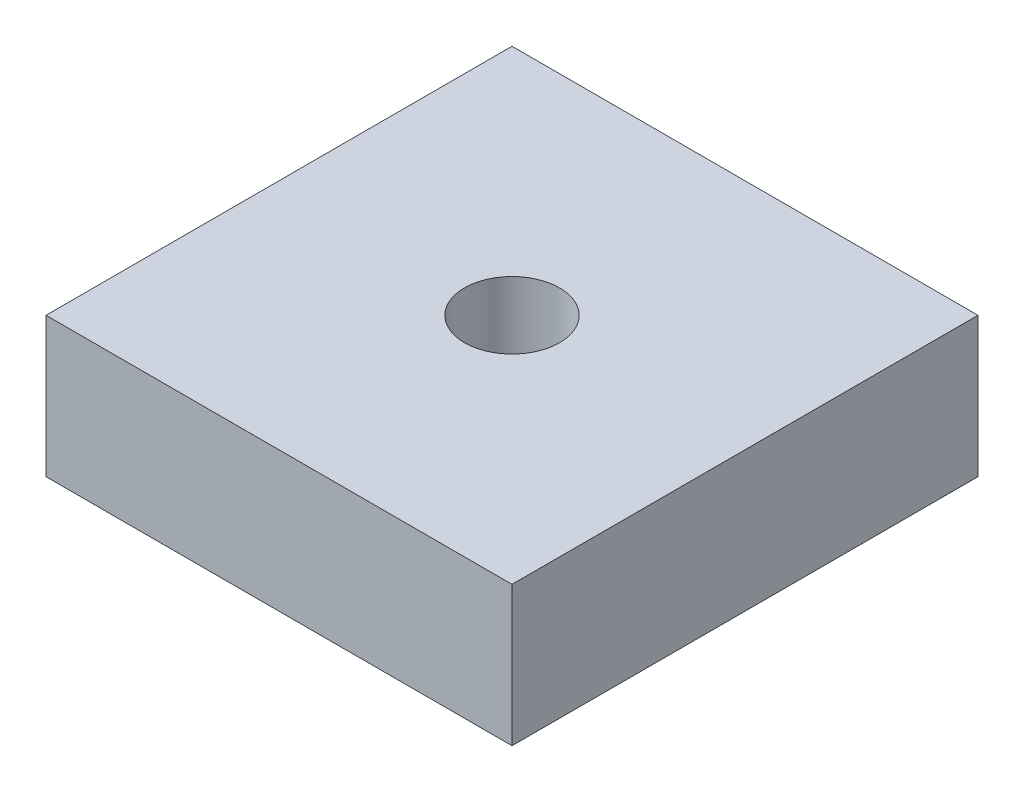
ISO-10303-21;
HEADER;
FILE_DESCRIPTION(('STEP AP214'),'2;1');
FILE_NAME('part.step','',(''),(''),'','','');
FILE_SCHEMA(('AUTOMOTIVE_DESIGN { 1 0 10303 214 1 1 1 1 }'));
ENDSEC;
DATA;
#1=APPLICATION_CONTEXT('core data for automotive mechanical design processes');
#2=APPLICATION_PROTOCOL_DEFINITION('international standard','automotive_design',2000,#1);
#3=PRODUCT_CONTEXT('',#1,'mechanical');
#4=PRODUCT('Part','Part','',(#3));
#5=PRODUCT_RELATED_PRODUCT_CATEGORY('part','',(#4));
#6=PRODUCT_DEFINITION_FORMATION('','',#4);
#7=PRODUCT_DEFINITION_CONTEXT('part definition',#1,'design');
#8=PRODUCT_DEFINITION('design','',#6,#7);
#9=PRODUCT_DEFINITION_SHAPE('','',#8);
#10=(LENGTH_UNIT() NAMED_UNIT(*) SI_UNIT(.MILLI.,.METRE.));
#11=(NAMED_UNIT(*) PLANE_ANGLE_UNIT() SI_UNIT($,.RADIAN.));
#12=(NAMED_UNIT(*) SI_UNIT($,.STERADIAN.) SOLID_ANGLE_UNIT());
#13=UNCERTAINTY_MEASURE_WITH_UNIT(LENGTH_MEASURE(1.E-05),#10,'distance_accuracy_value','');
#14=(GEOMETRIC_REPRESENTATION_CONTEXT(3) GLOBAL_UNCERTAINTY_ASSIGNED_CONTEXT((#13)) GLOBAL_UNIT_ASSIGNED_CONTEXT((#10,
#11,#12)) REPRESENTATION_CONTEXT('',''));
#15=CARTESIAN_POINT('',(0.,0.,0.));
#16=DIRECTION('',(0.,0.,1.));
#17=DIRECTION('',(1.,0.,0.));
#18=AXIS2_PLACEMENT_3D('',#15,#16,#17);
#19=CARTESIAN_POINT('',(-25.,15.,25.));
#20=DIRECTION('',(1.,0.,0.));
#21=DIRECTION('',(0.,0.,-1.));
#22=AXIS2_PLACEMENT_3D('',#19,#20,#21);
#23=PLANE('',#22);
#24=DIRECTION('',(0.,0.,1.));
#25=VECTOR('',#24,1.);
#26=CARTESIAN_POINT('',(-25.,0.,25.));
#27=LINE('',#26,#25);
#28=CARTESIAN_POINT('',(-25.,0.,-25.));
#29=VERTEX_POINT('',#28);
#30=CARTESIAN_POINT('',(-25.,0.,25.));
#31=VERTEX_POINT('',#30);
#32=EDGE_CURVE('E76',#29,#31,#27,.T.);
#33=ORIENTED_EDGE('',*,*,#32,.T.);
#34=DIRECTION('',(0.,-1.,0.));
#35=VECTOR('',#34,1.);
#36=CARTESIAN_POINT('',(-25.,15.,25.));
#37=LINE('',#36,#35);
#38=CARTESIAN_POINT('',(-25.,15.,25.));
#39=VERTEX_POINT('',#38);
#40=EDGE_CURVE('E11',#39,#31,#37,.T.);
#41=ORIENTED_EDGE('',*,*,#40,.F.);
#42=DIRECTION('',(0.,0.,1.));
#43=VECTOR('',#42,1.);
#44=CARTESIAN_POINT('',(-25.,15.,25.));
#45=LINE('',#44,#43);
#46=CARTESIAN_POINT('',(-25.,15.,-25.));
#47=VERTEX_POINT('',#46);
#48=EDGE_CURVE('E99',#47,#39,#45,.T.);
#49=ORIENTED_EDGE('',*,*,#48,.F.);
#50=DIRECTION('',(0.,-1.,0.));
#51=VECTOR('',#50,1.);
#52=CARTESIAN_POINT('',(-25.,15.,-25.));
#53=LINE('',#52,#51);
#54=EDGE_CURVE('E88',#47,#29,#53,.T.);
#55=ORIENTED_EDGE('',*,*,#54,.T.);
#56=EDGE_LOOP('',(#33,#41,#49,#55));
#57=FACE_BOUND('',#56,.T.);
#58=ADVANCED_FACE('F32',(#57),#23,.F.);
#59=CARTESIAN_POINT('',(-25.,15.,25.));
#60=DIRECTION('',(0.,0.,-1.));
#61=DIRECTION('',(-1.,0.,0.));
#62=AXIS2_PLACEMENT_3D('',#59,#60,#61);
#63=PLANE('',#62);
#64=DIRECTION('',(1.,0.,0.));
#65=VECTOR('',#64,1.);
#66=CARTESIAN_POINT('',(-25.,0.,25.));
#67=LINE('',#66,#65);
#68=CARTESIAN_POINT('',(25.,0.,25.));
#69=VERTEX_POINT('',#68);
#70=EDGE_CURVE('E72',#31,#69,#67,.T.);
#71=ORIENTED_EDGE('',*,*,#70,.T.);
#72=DIRECTION('',(0.,-1.,0.));
#73=VECTOR('',#72,1.);
#74=CARTESIAN_POINT('',(25.,15.,25.));
#75=LINE('',#74,#73);
#76=CARTESIAN_POINT('',(25.,15.,25.));
#77=VERTEX_POINT('',#76);
#78=EDGE_CURVE('E39',#77,#69,#75,.T.);
#79=ORIENTED_EDGE('',*,*,#78,.F.);
#80=DIRECTION('',(1.,0.,0.));
#81=VECTOR('',#80,1.);
#82=CARTESIAN_POINT('',(-25.,15.,25.));
#83=LINE('',#82,#81);
#84=EDGE_CURVE('E84',#39,#77,#83,.T.);
#85=ORIENTED_EDGE('',*,*,#84,.F.);
#86=ORIENTED_EDGE('',*,*,#40,.T.);
#87=EDGE_LOOP('',(#71,#79,#85,#86));
#88=FACE_BOUND('',#87,.T.);
#89=ADVANCED_FACE('F83',(#88),#63,.F.);
#90=CARTESIAN_POINT('',(25.,15.,25.));
#91=DIRECTION('',(-1.,0.,0.));
#92=DIRECTION('',(0.,0.,1.));
#93=AXIS2_PLACEMENT_3D('',#90,#91,#92);
#94=PLANE('',#93);
#95=DIRECTION('',(0.,0.,-1.));
#96=VECTOR('',#95,1.);
#97=CARTESIAN_POINT('',(25.,0.,25.));
#98=LINE('',#97,#96);
#99=CARTESIAN_POINT('',(25.,0.,-25.));
#100=VERTEX_POINT('',#99);
#101=EDGE_CURVE('E77',#69,#100,#98,.T.);
#102=ORIENTED_EDGE('',*,*,#101,.T.);
#103=DIRECTION('',(0.,-1.,0.));
#104=VECTOR('',#103,1.);
#105=CARTESIAN_POINT('',(25.,15.,-25.));
#106=LINE('',#105,#104);
#107=CARTESIAN_POINT('',(25.,15.,-25.));
#108=VERTEX_POINT('',#107);
#109=EDGE_CURVE('E105',#108,#100,#106,.T.);
#110=ORIENTED_EDGE('',*,*,#109,.F.);
#111=DIRECTION('',(0.,0.,-1.));
#112=VECTOR('',#111,1.);
#113=CARTESIAN_POINT('',(25.,15.,25.));
#114=LINE('',#113,#112);
#115=EDGE_CURVE('E51',#77,#108,#114,.T.);
#116=ORIENTED_EDGE('',*,*,#115,.F.);
#117=ORIENTED_EDGE('',*,*,#78,.T.);
#118=EDGE_LOOP('',(#102,#110,#116,#117));
#119=FACE_BOUND('',#118,.T.);
#120=ADVANCED_FACE('F108',(#119),#94,.F.);
#121=CARTESIAN_POINT('',(-25.,15.,-25.));
#122=DIRECTION('',(0.,0.,1.));
#123=DIRECTION('',(1.,0.,0.));
#124=AXIS2_PLACEMENT_3D('',#121,#122,#123);
#125=PLANE('',#124);
#126=DIRECTION('',(-1.,0.,0.));
#127=VECTOR('',#126,1.);
#128=CARTESIAN_POINT('',(-25.,0.,-25.));
#129=LINE('',#128,#127);
#130=EDGE_CURVE('E97',#100,#29,#129,.T.);
#131=ORIENTED_EDGE('',*,*,#130,.T.);
#132=ORIENTED_EDGE('',*,*,#54,.F.);
#133=DIRECTION('',(-1.,0.,0.));
#134=VECTOR('',#133,1.);
#135=CARTESIAN_POINT('',(-25.,15.,-25.));
#136=LINE('',#135,#134);
#137=EDGE_CURVE('E46',#108,#47,#136,.T.);
#138=ORIENTED_EDGE('',*,*,#137,.F.);
#139=ORIENTED_EDGE('',*,*,#109,.T.);
#140=EDGE_LOOP('',(#131,#132,#138,#139));
#141=FACE_BOUND('',#140,.T.);
#142=ADVANCED_FACE('F110',(#141),#125,.F.);
#143=CARTESIAN_POINT('',(-25.,15.,-25.));
#144=DIRECTION('',(0.,-1.,0.));
#145=DIRECTION('',(0.,0.,-1.));
#146=AXIS2_PLACEMENT_3D('',#143,#144,#145);
#147=PLANE('',#146);
#148=CARTESIAN_POINT('',(0.,15.,0.));
#149=DIRECTION('',(0.,1.,0.));
#150=DIRECTION('',(0.,0.,1.));
#151=AXIS2_PLACEMENT_3D('',#148,#149,#150);
#152=CIRCLE('',#151,5.09999999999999);
#153=CARTESIAN_POINT('',(0.,15.,5.09999999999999));
#154=VERTEX_POINT('',#153);
#155=EDGE_CURVE('E92',#154,#154,#152,.T.);
#156=ORIENTED_EDGE('',*,*,#155,.F.);
#157=EDGE_LOOP('',(#156));
#158=FACE_BOUND('',#157,.T.);
#159=ORIENTED_EDGE('',*,*,#48,.T.);
#160=ORIENTED_EDGE('',*,*,#84,.T.);
#161=ORIENTED_EDGE('',*,*,#115,.T.);
#162=ORIENTED_EDGE('',*,*,#137,.T.);
#163=EDGE_LOOP('',(#159,#160,#161,#162));
#164=FACE_BOUND('',#163,.T.);
#165=ADVANCED_FACE('F111',(#158,#164),#147,.F.);
#166=CARTESIAN_POINT('',(-25.,0.,-25.));
#167=DIRECTION('',(0.,-1.,0.));
#168=DIRECTION('',(0.,0.,-1.));
#169=AXIS2_PLACEMENT_3D('',#166,#167,#168);
#170=PLANE('',#169);
#171=CARTESIAN_POINT('',(0.,0.,0.));
#172=DIRECTION('',(0.,-1.,0.));
#173=DIRECTION('',(0.,0.,-1.));
#174=AXIS2_PLACEMENT_3D('',#171,#172,#173);
#175=CIRCLE('',#174,5.09999999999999);
#176=CARTESIAN_POINT('',(0.,0.,-5.09999999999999));
#177=VERTEX_POINT('',#176);
#178=EDGE_CURVE('E89',#177,#177,#175,.T.);
#179=ORIENTED_EDGE('',*,*,#178,.F.);
#180=EDGE_LOOP('',(#179));
#181=FACE_BOUND('',#180,.T.);
#182=ORIENTED_EDGE('',*,*,#32,.F.);
#183=ORIENTED_EDGE('',*,*,#130,.F.);
#184=ORIENTED_EDGE('',*,*,#101,.F.);
#185=ORIENTED_EDGE('',*,*,#70,.F.);
#186=EDGE_LOOP('',(#182,#183,#184,#185));
#187=FACE_BOUND('',#186,.T.);
#188=ADVANCED_FACE('F73',(#181,#187),#170,.T.);
#189=CARTESIAN_POINT('',(0.,15.,0.));
#190=DIRECTION('',(0.,1.,0.));
#191=DIRECTION('',(0.,0.,1.));
#192=AXIS2_PLACEMENT_3D('',#189,#190,#191);
#193=CYLINDRICAL_SURFACE('',#192,5.09999999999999);
#194=ORIENTED_EDGE('',*,*,#155,.T.);
#195=EDGE_LOOP('',(#194));
#196=FACE_BOUND('',#195,.T.);
#197=ORIENTED_EDGE('',*,*,#178,.T.);
#198=EDGE_LOOP('',(#197));
#199=FACE_BOUND('',#198,.T.);
#200=ADVANCED_FACE('F119',(#196,#199),#193,.F.);
#201=CLOSED_SHELL('',(#58,#89,#120,#142,#165,#188,#200));
#202=MANIFOLD_SOLID_BREP('B2',#201);
#203=ADVANCED_BREP_SHAPE_REPRESENTATION('',(#18,#202),#14);
#204=SHAPE_DEFINITION_REPRESENTATION(#9,#203);
ENDSEC;
END-ISO-10303-21;
